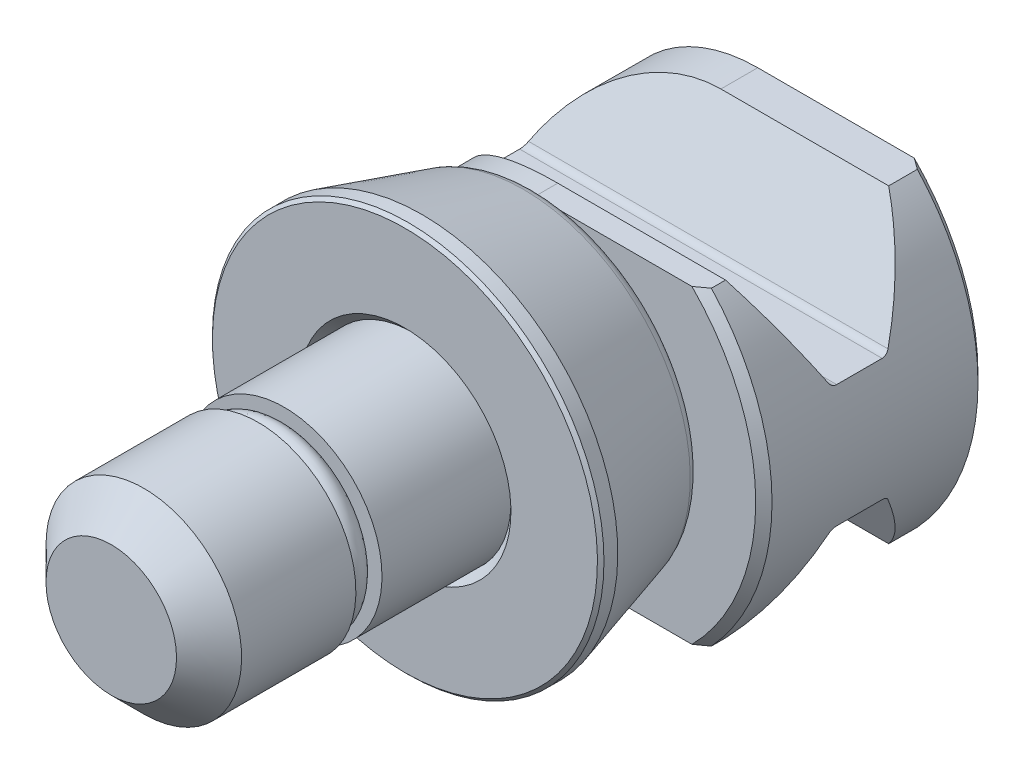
ISO-10303-21;
HEADER;
FILE_DESCRIPTION(('STEP AP214'),'2;1');
FILE_NAME('part.step','',(''),(''),'','','');
FILE_SCHEMA(('AUTOMOTIVE_DESIGN { 1 0 10303 214 1 1 1 1 }'));
ENDSEC;
DATA;
#1=APPLICATION_CONTEXT('core data for automotive mechanical design processes');
#2=APPLICATION_PROTOCOL_DEFINITION('international standard','automotive_design',2000,#1);
#3=PRODUCT_CONTEXT('',#1,'mechanical');
#4=PRODUCT('Part','Part','',(#3));
#5=PRODUCT_RELATED_PRODUCT_CATEGORY('part','',(#4));
#6=PRODUCT_DEFINITION_FORMATION('','',#4);
#7=PRODUCT_DEFINITION_CONTEXT('part definition',#1,'design');
#8=PRODUCT_DEFINITION('design','',#6,#7);
#9=PRODUCT_DEFINITION_SHAPE('','',#8);
#10=(LENGTH_UNIT() NAMED_UNIT(*) SI_UNIT(.MILLI.,.METRE.));
#11=(NAMED_UNIT(*) PLANE_ANGLE_UNIT() SI_UNIT($,.RADIAN.));
#12=(NAMED_UNIT(*) SI_UNIT($,.STERADIAN.) SOLID_ANGLE_UNIT());
#13=UNCERTAINTY_MEASURE_WITH_UNIT(LENGTH_MEASURE(1.E-05),#10,'distance_accuracy_value','');
#14=(GEOMETRIC_REPRESENTATION_CONTEXT(3) GLOBAL_UNCERTAINTY_ASSIGNED_CONTEXT((#13)) GLOBAL_UNIT_ASSIGNED_CONTEXT((#10,
#11,#12)) REPRESENTATION_CONTEXT('',''));
#15=CARTESIAN_POINT('',(0.,0.,0.));
#16=DIRECTION('',(0.,0.,1.));
#17=DIRECTION('',(1.,0.,0.));
#18=AXIS2_PLACEMENT_3D('',#15,#16,#17);
#19=CARTESIAN_POINT('',(4.8,0.,8.15));
#20=DIRECTION('',(0.,-1.,0.));
#21=DIRECTION('',(0.,0.,1.));
#22=AXIS2_PLACEMENT_3D('',#19,#20,#21);
#23=ELLIPSE('',#22,0.75,0.75);
#24=CARTESIAN_POINT('',(0.,0.,8.15));
#25=DIRECTION('',(0.,0.,-1.));
#26=AXIS1_PLACEMENT('',#24,#25);
#27=SURFACE_OF_REVOLUTION('',#23,#26);
#28=CARTESIAN_POINT('',(0.,0.,8.4));
#29=DIRECTION('',(0.,0.,-1.));
#30=DIRECTION('',(0.,1.,0.));
#31=AXIS2_PLACEMENT_3D('',#28,#29,#30);
#32=CIRCLE('',#31,4.09289321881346);
#33=CARTESIAN_POINT('',(0.,4.09289321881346,8.4));
#34=VERTEX_POINT('',#33);
#35=EDGE_CURVE('E23',#34,#34,#32,.F.);
#36=ORIENTED_EDGE('',*,*,#35,.F.);
#37=EDGE_LOOP('',(#36));
#38=FACE_BOUND('',#37,.T.);
#39=CARTESIAN_POINT('',(0.,0.,7.4));
#40=DIRECTION('',(0.,0.,-1.));
#41=DIRECTION('',(0.,1.,0.));
#42=AXIS2_PLACEMENT_3D('',#39,#40,#41);
#43=CIRCLE('',#42,4.8);
#44=CARTESIAN_POINT('',(0.,4.8,7.4));
#45=VERTEX_POINT('',#44);
#46=EDGE_CURVE('E9',#45,#45,#43,.F.);
#47=ORIENTED_EDGE('',*,*,#46,.T.);
#48=EDGE_LOOP('',(#47));
#49=FACE_BOUND('',#48,.T.);
#50=ADVANCED_FACE('F14',(#38,#49),#27,.F.);
#51=CARTESIAN_POINT('',(0.,0.,18.));
#52=DIRECTION('',(0.,0.,1.));
#53=DIRECTION('',(0.,1.,0.));
#54=AXIS2_PLACEMENT_3D('',#51,#52,#53);
#55=PLANE('',#54);
#56=CARTESIAN_POINT('',(0.,0.,18.));
#57=DIRECTION('',(0.,0.,1.));
#58=DIRECTION('',(0.,1.,0.));
#59=AXIS2_PLACEMENT_3D('',#56,#57,#58);
#60=CIRCLE('',#59,4.);
#61=CARTESIAN_POINT('',(0.,4.,18.));
#62=VERTEX_POINT('',#61);
#63=EDGE_CURVE('E298',#62,#62,#60,.T.);
#64=ORIENTED_EDGE('',*,*,#63,.T.);
#65=EDGE_LOOP('',(#64));
#66=FACE_BOUND('',#65,.T.);
#67=ADVANCED_FACE('F410',(#66),#55,.T.);
#68=CARTESIAN_POINT('',(0.,0.,16.));
#69=DIRECTION('',(0.,0.,-1.));
#70=DIRECTION('',(0.,-1.,0.));
#71=AXIS2_PLACEMENT_3D('',#68,#69,#70);
#72=CONICAL_SURFACE('',#71,6.,0.78539816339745);
#73=CARTESIAN_POINT('',(0.,0.,16.005));
#74=DIRECTION('',(0.,0.,-1.));
#75=DIRECTION('',(0.,-1.,0.));
#76=AXIS2_PLACEMENT_3D('',#73,#74,#75);
#77=CIRCLE('',#76,5.995);
#78=CARTESIAN_POINT('',(0.,-5.995,16.005));
#79=VERTEX_POINT('',#78);
#80=EDGE_CURVE('E250',#79,#79,#77,.T.);
#81=ORIENTED_EDGE('',*,*,#80,.F.);
#82=EDGE_LOOP('',(#81));
#83=FACE_BOUND('',#82,.T.);
#84=ORIENTED_EDGE('',*,*,#63,.F.);
#85=EDGE_LOOP('',(#84));
#86=FACE_BOUND('',#85,.T.);
#87=ADVANCED_FACE('F373',(#83,#86),#72,.T.);
#88=CARTESIAN_POINT('',(0.,0.,-8.));
#89=DIRECTION('',(0.,0.,-1.));
#90=DIRECTION('',(0.,-1.,0.));
#91=AXIS2_PLACEMENT_3D('',#88,#89,#90);
#92=CYLINDRICAL_SURFACE('',#91,5.995);
#93=CARTESIAN_POINT('',(0.,0.,9.));
#94=DIRECTION('',(0.,0.,-1.));
#95=DIRECTION('',(0.,-1.,0.));
#96=AXIS2_PLACEMENT_3D('',#93,#94,#95);
#97=CIRCLE('',#96,5.995);
#98=CARTESIAN_POINT('',(0.,-5.995,9.));
#99=VERTEX_POINT('',#98);
#100=EDGE_CURVE('E241',#99,#99,#97,.T.);
#101=ORIENTED_EDGE('',*,*,#100,.F.);
#102=EDGE_LOOP('',(#101));
#103=FACE_BOUND('',#102,.T.);
#104=ORIENTED_EDGE('',*,*,#80,.T.);
#105=EDGE_LOOP('',(#104));
#106=FACE_BOUND('',#105,.T.);
#107=ADVANCED_FACE('F551',(#103,#106),#92,.T.);
#108=CARTESIAN_POINT('',(-5.995,0.,9.));
#109=DIRECTION('',(0.,0.,1.));
#110=DIRECTION('',(0.,1.,0.));
#111=AXIS2_PLACEMENT_3D('',#108,#109,#110);
#112=PLANE('',#111);
#113=CARTESIAN_POINT('',(0.,0.,9.));
#114=DIRECTION('',(0.,0.,-1.));
#115=DIRECTION('',(0.,-1.,0.));
#116=AXIS2_PLACEMENT_3D('',#113,#114,#115);
#117=CIRCLE('',#116,4.05);
#118=CARTESIAN_POINT('',(0.,-4.05,9.));
#119=VERTEX_POINT('',#118);
#120=EDGE_CURVE('E209',#119,#119,#117,.T.);
#121=ORIENTED_EDGE('',*,*,#120,.F.);
#122=EDGE_LOOP('',(#121));
#123=FACE_BOUND('',#122,.T.);
#124=ORIENTED_EDGE('',*,*,#100,.T.);
#125=EDGE_LOOP('',(#124));
#126=FACE_BOUND('',#125,.T.);
#127=ADVANCED_FACE('F558',(#123,#126),#112,.F.);
#128=CARTESIAN_POINT('',(0.,0.,-8.));
#129=DIRECTION('',(0.,0.,-1.));
#130=DIRECTION('',(0.,-1.,0.));
#131=AXIS2_PLACEMENT_3D('',#128,#129,#130);
#132=CYLINDRICAL_SURFACE('',#131,4.05);
#133=CARTESIAN_POINT('',(0.,0.,8.4));
#134=DIRECTION('',(0.,0.,1.));
#135=DIRECTION('',(0.,1.,0.));
#136=AXIS2_PLACEMENT_3D('',#133,#134,#135);
#137=CIRCLE('',#136,4.05);
#138=CARTESIAN_POINT('',(0.,4.05,8.4));
#139=VERTEX_POINT('',#138);
#140=EDGE_CURVE('E237',#139,#139,#137,.T.);
#141=ORIENTED_EDGE('',*,*,#140,.T.);
#142=EDGE_LOOP('',(#141));
#143=FACE_BOUND('',#142,.T.);
#144=ORIENTED_EDGE('',*,*,#120,.T.);
#145=EDGE_LOOP('',(#144));
#146=FACE_BOUND('',#145,.T.);
#147=ADVANCED_FACE('F566',(#143,#146),#132,.T.);
#148=CARTESIAN_POINT('',(0.,0.,8.4));
#149=DIRECTION('',(0.,0.,1.));
#150=DIRECTION('',(0.,1.,0.));
#151=AXIS2_PLACEMENT_3D('',#148,#149,#150);
#152=PLANE('',#151);
#153=ORIENTED_EDGE('',*,*,#140,.F.);
#154=EDGE_LOOP('',(#153));
#155=FACE_BOUND('',#154,.T.);
#156=ORIENTED_EDGE('',*,*,#35,.T.);
#157=EDGE_LOOP('',(#156));
#158=FACE_BOUND('',#157,.T.);
#159=ADVANCED_FACE('F545',(#155,#158),#152,.T.);
#160=CARTESIAN_POINT('',(0.,0.,-7.));
#161=DIRECTION('',(0.,0.,-1.));
#162=DIRECTION('',(0.,1.,0.));
#163=AXIS2_PLACEMENT_3D('',#160,#161,#162);
#164=TOROIDAL_SURFACE('',#163,9.2524828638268,1.);
#165=CARTESIAN_POINT('',(0.,0.,-7.275637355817));
#166=DIRECTION('',(0.,0.,-1.));
#167=DIRECTION('',(0.,1.,0.));
#168=AXIS2_PLACEMENT_3D('',#165,#166,#167);
#169=CIRCLE('',#168,10.2137445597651);
#170=CARTESIAN_POINT('',(0.,10.2137445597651,-7.275637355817));
#171=VERTEX_POINT('',#170);
#172=EDGE_CURVE('E507',#171,#171,#169,.F.);
#173=ORIENTED_EDGE('',*,*,#172,.F.);
#174=EDGE_LOOP('',(#173));
#175=FACE_BOUND('',#174,.T.);
#176=CARTESIAN_POINT('',(0.,0.,-8.));
#177=DIRECTION('',(0.,0.,-1.));
#178=DIRECTION('',(0.,1.,0.));
#179=AXIS2_PLACEMENT_3D('',#176,#177,#178);
#180=CIRCLE('',#179,9.2524828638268);
#181=CARTESIAN_POINT('',(0.,9.2524828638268,-8.));
#182=VERTEX_POINT('',#181);
#183=EDGE_CURVE('E499',#182,#182,#180,.T.);
#184=ORIENTED_EDGE('',*,*,#183,.F.);
#185=EDGE_LOOP('',(#184));
#186=FACE_BOUND('',#185,.T.);
#187=ADVANCED_FACE('F538',(#175,#186),#164,.T.);
#188=CARTESIAN_POINT('',(0.,0.,-8.));
#189=DIRECTION('',(0.,0.,1.));
#190=DIRECTION('',(0.,-1.,0.));
#191=AXIS2_PLACEMENT_3D('',#188,#189,#190);
#192=CONICAL_SURFACE('',#191,10.0060369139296,0.279252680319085);
#193=ORIENTED_EDGE('',*,*,#172,.T.);
#194=EDGE_LOOP('',(#193));
#195=FACE_BOUND('',#194,.T.);
#196=CARTESIAN_POINT('',(0.,0.,-1.0462243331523));
#197=DIRECTION('',(0.,0.,-1.));
#198=DIRECTION('',(0.,1.,0.));
#199=AXIS2_PLACEMENT_3D('',#196,#197,#198);
#200=CIRCLE('',#199,12.);
#201=CARTESIAN_POINT('',(0.,12.,-1.0462243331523));
#202=VERTEX_POINT('',#201);
#203=EDGE_CURVE('E504',#202,#202,#200,.T.);
#204=ORIENTED_EDGE('',*,*,#203,.T.);
#205=EDGE_LOOP('',(#204));
#206=FACE_BOUND('',#205,.T.);
#207=ADVANCED_FACE('F594',(#195,#206),#192,.T.);
#208=CARTESIAN_POINT('',(0.,0.,0.));
#209=DIRECTION('',(0.,0.,-1.));
#210=DIRECTION('',(0.,1.,0.));
#211=AXIS2_PLACEMENT_3D('',#208,#209,#210);
#212=CYLINDRICAL_SURFACE('',#211,12.);
#213=CARTESIAN_POINT('',(0.,0.,-0.2));
#214=DIRECTION('',(0.,0.,1.));
#215=DIRECTION('',(0.,-1.,0.));
#216=AXIS2_PLACEMENT_3D('',#213,#214,#215);
#217=CIRCLE('',#216,12.);
#218=CARTESIAN_POINT('',(0.,-12.,-0.2));
#219=VERTEX_POINT('',#218);
#220=EDGE_CURVE('E515',#219,#219,#217,.F.);
#221=ORIENTED_EDGE('',*,*,#220,.T.);
#222=EDGE_LOOP('',(#221));
#223=FACE_BOUND('',#222,.T.);
#224=ORIENTED_EDGE('',*,*,#203,.F.);
#225=EDGE_LOOP('',(#224));
#226=FACE_BOUND('',#225,.T.);
#227=ADVANCED_FACE('F537',(#223,#226),#212,.T.);
#228=CARTESIAN_POINT('',(0.,0.,0.));
#229=DIRECTION('',(0.,0.,-1.));
#230=DIRECTION('',(0.,1.,0.));
#231=AXIS2_PLACEMENT_3D('',#228,#229,#230);
#232=CYLINDRICAL_SURFACE('',#231,6.);
#233=CARTESIAN_POINT('',(0.,0.,-0.5));
#234=DIRECTION('',(0.,0.,1.));
#235=DIRECTION('',(0.,-1.,0.));
#236=AXIS2_PLACEMENT_3D('',#233,#234,#235);
#237=CIRCLE('',#236,6.);
#238=CARTESIAN_POINT('',(0.,-6.,-0.5));
#239=VERTEX_POINT('',#238);
#240=EDGE_CURVE('E513',#239,#239,#237,.T.);
#241=ORIENTED_EDGE('',*,*,#240,.T.);
#242=EDGE_LOOP('',(#241));
#243=FACE_BOUND('',#242,.T.);
#244=CARTESIAN_POINT('',(0.,0.,-1.));
#245=DIRECTION('',(0.,0.,-1.));
#246=DIRECTION('',(0.,-1.,0.));
#247=AXIS2_PLACEMENT_3D('',#244,#245,#246);
#248=CIRCLE('',#247,6.);
#249=CARTESIAN_POINT('',(0.,-6.,-1.));
#250=VERTEX_POINT('',#249);
#251=EDGE_CURVE('E244',#250,#250,#248,.T.);
#252=ORIENTED_EDGE('',*,*,#251,.T.);
#253=EDGE_LOOP('',(#252));
#254=FACE_BOUND('',#253,.T.);
#255=ADVANCED_FACE('F540',(#243,#254),#232,.F.);
#256=CARTESIAN_POINT('',(0.,0.,0.));
#257=DIRECTION('',(0.,0.,1.));
#258=DIRECTION('',(0.,-1.,0.));
#259=AXIS2_PLACEMENT_3D('',#256,#257,#258);
#260=CONICAL_SURFACE('',#259,6.5,0.785398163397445);
#261=ORIENTED_EDGE('',*,*,#240,.F.);
#262=EDGE_LOOP('',(#261));
#263=FACE_BOUND('',#262,.T.);
#264=CARTESIAN_POINT('',(0.,0.,0.));
#265=DIRECTION('',(0.,0.,1.));
#266=DIRECTION('',(0.,-1.,0.));
#267=AXIS2_PLACEMENT_3D('',#264,#265,#266);
#268=CIRCLE('',#267,6.5);
#269=CARTESIAN_POINT('',(0.,-6.5,0.));
#270=VERTEX_POINT('',#269);
#271=EDGE_CURVE('E510',#270,#270,#268,.F.);
#272=ORIENTED_EDGE('',*,*,#271,.F.);
#273=EDGE_LOOP('',(#272));
#274=FACE_BOUND('',#273,.T.);
#275=ADVANCED_FACE('F528',(#263,#274),#260,.F.);
#276=CARTESIAN_POINT('',(6.,0.,0.));
#277=DIRECTION('',(0.,0.,1.));
#278=DIRECTION('',(0.,-1.,0.));
#279=AXIS2_PLACEMENT_3D('',#276,#277,#278);
#280=PLANE('',#279);
#281=CARTESIAN_POINT('',(0.,0.,0.));
#282=DIRECTION('',(0.,0.,1.));
#283=DIRECTION('',(0.,-1.,0.));
#284=AXIS2_PLACEMENT_3D('',#281,#282,#283);
#285=CIRCLE('',#284,11.8);
#286=CARTESIAN_POINT('',(0.,-11.8,0.));
#287=VERTEX_POINT('',#286);
#288=EDGE_CURVE('E18',#287,#287,#285,.T.);
#289=ORIENTED_EDGE('',*,*,#288,.T.);
#290=EDGE_LOOP('',(#289));
#291=FACE_BOUND('',#290,.T.);
#292=ORIENTED_EDGE('',*,*,#271,.T.);
#293=EDGE_LOOP('',(#292));
#294=FACE_BOUND('',#293,.T.);
#295=ADVANCED_FACE('F522',(#291,#294),#280,.T.);
#296=CARTESIAN_POINT('',(0.,0.,-0.2));
#297=DIRECTION('',(0.,0.,-1.));
#298=DIRECTION('',(0.,1.,0.));
#299=AXIS2_PLACEMENT_3D('',#296,#297,#298);
#300=CONICAL_SURFACE('',#299,12.,0.785398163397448);
#301=ORIENTED_EDGE('',*,*,#288,.F.);
#302=EDGE_LOOP('',(#301));
#303=FACE_BOUND('',#302,.T.);
#304=ORIENTED_EDGE('',*,*,#220,.F.);
#305=EDGE_LOOP('',(#304));
#306=FACE_BOUND('',#305,.T.);
#307=ADVANCED_FACE('F16',(#303,#306),#300,.T.);
#308=CARTESIAN_POINT('',(-6.,0.,-1.));
#309=DIRECTION('',(0.,0.,-1.));
#310=DIRECTION('',(0.,-1.,0.));
#311=AXIS2_PLACEMENT_3D('',#308,#309,#310);
#312=PLANE('',#311);
#313=ORIENTED_EDGE('',*,*,#251,.F.);
#314=EDGE_LOOP('',(#313));
#315=FACE_BOUND('',#314,.T.);
#316=CARTESIAN_POINT('',(0.,0.,-1.));
#317=DIRECTION('',(0.,0.,-1.));
#318=DIRECTION('',(0.,-1.,0.));
#319=AXIS2_PLACEMENT_3D('',#316,#317,#318);
#320=CIRCLE('',#319,5.995);
#321=CARTESIAN_POINT('',(0.,-5.995,-1.));
#322=VERTEX_POINT('',#321);
#323=EDGE_CURVE('E247',#322,#322,#320,.T.);
#324=ORIENTED_EDGE('',*,*,#323,.T.);
#325=EDGE_LOOP('',(#324));
#326=FACE_BOUND('',#325,.T.);
#327=ADVANCED_FACE('F527',(#315,#326),#312,.F.);
#328=CARTESIAN_POINT('',(0.,0.,7.4));
#329=DIRECTION('',(0.,0.,-1.));
#330=DIRECTION('',(0.,-1.,0.));
#331=AXIS2_PLACEMENT_3D('',#328,#329,#330);
#332=CIRCLE('',#331,5.995);
#333=CARTESIAN_POINT('',(0.,-5.995,7.4));
#334=VERTEX_POINT('',#333);
#335=EDGE_CURVE('E205',#334,#334,#332,.T.);
#336=ORIENTED_EDGE('',*,*,#335,.T.);
#337=EDGE_LOOP('',(#336));
#338=FACE_BOUND('',#337,.T.);
#339=ORIENTED_EDGE('',*,*,#323,.F.);
#340=EDGE_LOOP('',(#339));
#341=FACE_BOUND('',#340,.T.);
#342=ADVANCED_FACE('F534',(#338,#341),#92,.T.);
#343=CARTESIAN_POINT('',(-5.995,0.,7.4));
#344=DIRECTION('',(0.,0.,-1.));
#345=DIRECTION('',(0.,-1.,0.));
#346=AXIS2_PLACEMENT_3D('',#343,#344,#345);
#347=PLANE('',#346);
#348=ORIENTED_EDGE('',*,*,#46,.F.);
#349=EDGE_LOOP('',(#348));
#350=FACE_BOUND('',#349,.T.);
#351=ORIENTED_EDGE('',*,*,#335,.F.);
#352=EDGE_LOOP('',(#351));
#353=FACE_BOUND('',#352,.T.);
#354=ADVANCED_FACE('F572',(#350,#353),#347,.F.);
#355=CARTESIAN_POINT('',(0.,0.,-8.));
#356=DIRECTION('',(0.,0.,1.));
#357=DIRECTION('',(0.,1.,0.));
#358=AXIS2_PLACEMENT_3D('',#355,#356,#357);
#359=PLANE('',#358);
#360=ORIENTED_EDGE('',*,*,#183,.T.);
#361=EDGE_LOOP('',(#360));
#362=FACE_BOUND('',#361,.T.);
#363=DIRECTION('',(-1.,0.,0.));
#364=VECTOR('',#363,1.);
#365=CARTESIAN_POINT('',(0.,-9.5,-8.));
#366=LINE('',#365,#364);
#367=CARTESIAN_POINT('',(9.59166304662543,-9.5,-8.));
#368=VERTEX_POINT('',#367);
#369=CARTESIAN_POINT('',(0.,-9.5,-8.));
#370=VERTEX_POINT('',#369);
#371=EDGE_CURVE('E301',#368,#370,#366,.T.);
#372=ORIENTED_EDGE('',*,*,#371,.F.);
#373=CARTESIAN_POINT('',(0.,0.,-8.));
#374=DIRECTION('',(0.,0.,1.));
#375=DIRECTION('',(0.,1.,0.));
#376=AXIS2_PLACEMENT_3D('',#373,#374,#375);
#377=CIRCLE('',#376,13.5);
#378=CARTESIAN_POINT('',(9.59166304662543,9.5,-8.));
#379=VERTEX_POINT('',#378);
#380=EDGE_CURVE('E465',#368,#379,#377,.T.);
#381=ORIENTED_EDGE('',*,*,#380,.T.);
#382=DIRECTION('',(1.,0.,0.));
#383=VECTOR('',#382,1.);
#384=CARTESIAN_POINT('',(0.,9.5,-8.));
#385=LINE('',#384,#383);
#386=CARTESIAN_POINT('',(0.,9.5,-8.));
#387=VERTEX_POINT('',#386);
#388=EDGE_CURVE('E303',#387,#379,#385,.T.);
#389=ORIENTED_EDGE('',*,*,#388,.F.);
#390=CARTESIAN_POINT('',(0.,0.,-8.));
#391=DIRECTION('',(0.,0.,-1.));
#392=DIRECTION('',(0.,1.,0.));
#393=AXIS2_PLACEMENT_3D('',#390,#391,#392);
#394=CIRCLE('',#393,9.5);
#395=EDGE_CURVE('E282',#370,#387,#394,.T.);
#396=ORIENTED_EDGE('',*,*,#395,.F.);
#397=EDGE_LOOP('',(#372,#381,#389,#396));
#398=FACE_BOUND('',#397,.T.);
#399=ADVANCED_FACE('F408',(#362,#398),#359,.T.);
#400=CARTESIAN_POINT('',(15.,-9.5,-56.4039906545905));
#401=DIRECTION('',(0.,1.,0.));
#402=DIRECTION('',(0.,0.,-1.));
#403=AXIS2_PLACEMENT_3D('',#400,#401,#402);
#404=PLANE('',#403);
#405=DIRECTION('',(0.,0.,-1.));
#406=VECTOR('',#405,1.);
#407=CARTESIAN_POINT('',(10.2834819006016,-9.5,-8.));
#408=LINE('',#407,#406);
#409=CARTESIAN_POINT('',(10.2834819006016,-9.5,-9.3674137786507));
#410=VERTEX_POINT('',#409);
#411=CARTESIAN_POINT('',(10.2834819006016,-9.5,-8.5));
#412=VERTEX_POINT('',#411);
#413=EDGE_CURVE('E294',#410,#412,#408,.F.);
#414=ORIENTED_EDGE('',*,*,#413,.T.);
#415=CARTESIAN_POINT('',(10.2834819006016,-9.5,-8.5));
#416=CARTESIAN_POINT('',(10.1688365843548,-9.5,-8.41575654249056));
#417=CARTESIAN_POINT('',(10.0538623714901,-9.5,-8.33196815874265));
#418=CARTESIAN_POINT('',(9.82325608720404,-9.5,-8.16530149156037));
#419=CARTESIAN_POINT('',(9.70762401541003,-9.5,-8.08242320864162));
#420=CARTESIAN_POINT('',(9.59166304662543,-9.5,-8.));
#421=B_SPLINE_CURVE_WITH_KNOTS('',3,(#415,#416,#417,#418,#419,#420),.UNSPECIFIED.,.F.,.F.,(4,2,
4),(0.,0.426797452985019,0.853595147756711),.UNSPECIFIED.);
#422=EDGE_CURVE('E451',#412,#368,#421,.T.);
#423=ORIENTED_EDGE('',*,*,#422,.T.);
#424=ORIENTED_EDGE('',*,*,#371,.T.);
#425=DIRECTION('',(0.,0.,1.));
#426=VECTOR('',#425,1.);
#427=CARTESIAN_POINT('',(0.,-9.5,-40.));
#428=LINE('',#427,#426);
#429=CARTESIAN_POINT('',(0.,-9.5,-9.3674137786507));
#430=VERTEX_POINT('',#429);
#431=EDGE_CURVE('E285',#430,#370,#428,.T.);
#432=ORIENTED_EDGE('',*,*,#431,.F.);
#433=DIRECTION('',(1.,0.,0.));
#434=VECTOR('',#433,1.);
#435=CARTESIAN_POINT('',(15.,-9.5,-9.3674137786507));
#436=LINE('',#435,#434);
#437=EDGE_CURVE('E311',#430,#410,#436,.T.);
#438=ORIENTED_EDGE('',*,*,#437,.T.);
#439=EDGE_LOOP('',(#414,#423,#424,#432,#438));
#440=FACE_BOUND('',#439,.T.);
#441=ADVANCED_FACE('F445',(#440),#404,.F.);
#442=CARTESIAN_POINT('',(0.,0.,-8.5));
#443=DIRECTION('',(0.,0.,-1.));
#444=DIRECTION('',(0.,-1.,0.));
#445=AXIS2_PLACEMENT_3D('',#442,#443,#444);
#446=CONICAL_SURFACE('',#445,14.,0.785398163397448);
#447=CARTESIAN_POINT('',(9.59166304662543,9.5,-8.));
#448=CARTESIAN_POINT('',(9.70762401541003,9.50000000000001,-8.08242320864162));
#449=CARTESIAN_POINT('',(9.82325608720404,9.50000000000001,-8.16530149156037));
#450=CARTESIAN_POINT('',(10.0538623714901,9.50000000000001,-8.33196815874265));
#451=CARTESIAN_POINT('',(10.1688365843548,9.50000000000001,-8.41575654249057));
#452=CARTESIAN_POINT('',(10.2834819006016,9.5,-8.5));
#453=B_SPLINE_CURVE_WITH_KNOTS('',3,(#447,#448,#449,#450,#451,#452),.UNSPECIFIED.,.F.,.F.,(4,2,
4),(0.,0.426797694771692,0.853595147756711),.UNSPECIFIED.);
#454=CARTESIAN_POINT('',(10.2834819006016,9.5,-8.5));
#455=VERTEX_POINT('',#454);
#456=EDGE_CURVE('E458',#379,#455,#453,.T.);
#457=ORIENTED_EDGE('',*,*,#456,.F.);
#458=ORIENTED_EDGE('',*,*,#380,.F.);
#459=ORIENTED_EDGE('',*,*,#422,.F.);
#460=CARTESIAN_POINT('',(0.,0.,-8.5));
#461=DIRECTION('',(0.,0.,1.));
#462=DIRECTION('',(0.,1.,0.));
#463=AXIS2_PLACEMENT_3D('',#460,#461,#462);
#464=CIRCLE('',#463,14.);
#465=EDGE_CURVE('E624',#455,#412,#464,.F.);
#466=ORIENTED_EDGE('',*,*,#465,.F.);
#467=EDGE_LOOP('',(#457,#458,#459,#466));
#468=FACE_BOUND('',#467,.T.);
#469=ADVANCED_FACE('F439',(#468),#446,.T.);
#470=CARTESIAN_POINT('',(15.,9.5,-56.4039906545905));
#471=DIRECTION('',(0.,-1.,0.));
#472=DIRECTION('',(0.,0.,1.));
#473=AXIS2_PLACEMENT_3D('',#470,#471,#472);
#474=PLANE('',#473);
#475=ORIENTED_EDGE('',*,*,#388,.T.);
#476=ORIENTED_EDGE('',*,*,#456,.T.);
#477=DIRECTION('',(0.,0.,-1.));
#478=VECTOR('',#477,1.);
#479=CARTESIAN_POINT('',(10.2834819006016,9.5,-8.));
#480=LINE('',#479,#478);
#481=CARTESIAN_POINT('',(10.2834819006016,9.5,-9.3674137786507));
#482=VERTEX_POINT('',#481);
#483=EDGE_CURVE('E292',#455,#482,#480,.T.);
#484=ORIENTED_EDGE('',*,*,#483,.T.);
#485=DIRECTION('',(-1.,0.,0.));
#486=VECTOR('',#485,1.);
#487=CARTESIAN_POINT('',(15.,9.5,-9.3674137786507));
#488=LINE('',#487,#486);
#489=CARTESIAN_POINT('',(0.,9.5,-9.3674137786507));
#490=VERTEX_POINT('',#489);
#491=EDGE_CURVE('E256',#482,#490,#488,.T.);
#492=ORIENTED_EDGE('',*,*,#491,.T.);
#493=DIRECTION('',(0.,0.,1.));
#494=VECTOR('',#493,1.);
#495=CARTESIAN_POINT('',(0.,9.5,-40.));
#496=LINE('',#495,#494);
#497=EDGE_CURVE('E286',#490,#387,#496,.T.);
#498=ORIENTED_EDGE('',*,*,#497,.T.);
#499=EDGE_LOOP('',(#475,#476,#484,#492,#498));
#500=FACE_BOUND('',#499,.T.);
#501=ADVANCED_FACE('F444',(#500),#474,.F.);
#502=CARTESIAN_POINT('',(0.,0.,-40.));
#503=DIRECTION('',(0.,0.,1.));
#504=DIRECTION('',(0.,1.,0.));
#505=AXIS2_PLACEMENT_3D('',#502,#503,#504);
#506=CYLINDRICAL_SURFACE('',#505,9.5);
#507=CARTESIAN_POINT('',(0.,0.,-13.8825862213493));
#508=DIRECTION('',(0.,0.5,0.86602540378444));
#509=DIRECTION('',(0.,-0.866025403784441,0.5));
#510=AXIS2_PLACEMENT_3D('',#507,#508,#509);
#511=ELLIPSE('',#510,10.9696551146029,9.5);
#512=CARTESIAN_POINT('',(0.,9.5,-19.3674137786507));
#513=VERTEX_POINT('',#512);
#514=CARTESIAN_POINT('',(-8.61684396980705,4.,-16.1919872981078));
#515=VERTEX_POINT('',#514);
#516=EDGE_CURVE('E263',#513,#515,#511,.T.);
#517=ORIENTED_EDGE('',*,*,#516,.F.);
#518=CARTESIAN_POINT('',(0.,9.5,-21.625));
#519=VERTEX_POINT('',#518);
#520=EDGE_CURVE('E288',#519,#513,#496,.T.);
#521=ORIENTED_EDGE('',*,*,#520,.F.);
#522=CARTESIAN_POINT('',(0.,0.,-21.625));
#523=DIRECTION('',(0.,0.,1.));
#524=DIRECTION('',(0.,1.,0.));
#525=AXIS2_PLACEMENT_3D('',#522,#523,#524);
#526=CIRCLE('',#525,9.5);
#527=CARTESIAN_POINT('',(0.,-9.5,-21.625));
#528=VERTEX_POINT('',#527);
#529=EDGE_CURVE('E306',#519,#528,#526,.T.);
#530=ORIENTED_EDGE('',*,*,#529,.T.);
#531=CARTESIAN_POINT('',(0.,-9.5,-19.3674137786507));
#532=VERTEX_POINT('',#531);
#533=EDGE_CURVE('E289',#528,#532,#428,.T.);
#534=ORIENTED_EDGE('',*,*,#533,.T.);
#535=CARTESIAN_POINT('',(0.,0.,-13.8825862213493));
#536=DIRECTION('',(0.,0.5,-0.86602540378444));
#537=DIRECTION('',(0.,0.866025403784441,0.5));
#538=AXIS2_PLACEMENT_3D('',#535,#536,#537);
#539=ELLIPSE('',#538,10.9696551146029,9.5);
#540=CARTESIAN_POINT('',(-8.61684396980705,-4.,-16.1919872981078));
#541=VERTEX_POINT('',#540);
#542=EDGE_CURVE('E272',#532,#541,#539,.T.);
#543=ORIENTED_EDGE('',*,*,#542,.T.);
#544=CARTESIAN_POINT('',(-8.61684396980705,-4.,-16.1919872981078));
#545=CARTESIAN_POINT('',(-8.62782988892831,-3.9763405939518,-16.1783539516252));
#546=CARTESIAN_POINT('',(-8.63826486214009,-3.95359947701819,-16.1626141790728));
#547=CARTESIAN_POINT('',(-8.65779662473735,-3.91063964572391,-16.1272210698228));
#548=CARTESIAN_POINT('',(-8.66689002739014,-3.89042733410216,-16.1075581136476));
#549=CARTESIAN_POINT('',(-8.6834728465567,-3.85327385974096,-16.064617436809));
#550=CARTESIAN_POINT('',(-8.6909568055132,-3.83634384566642,-16.0413278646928));
#551=CARTESIAN_POINT('',(-8.70402475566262,-3.8066016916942,-15.9918471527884));
#552=CARTESIAN_POINT('',(-8.709613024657,-3.79378028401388,-15.9656627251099));
#553=CARTESIAN_POINT('',(-8.7188728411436,-3.77245264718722,-15.9101689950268));
#554=CARTESIAN_POINT('',(-8.72247157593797,-3.76411063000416,-15.8807830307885));
#555=CARTESIAN_POINT('',(-8.72610105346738,-3.75568486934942,-15.8357221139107));
#556=CARTESIAN_POINT('',(-8.7270161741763,-3.75355728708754,-15.8204707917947));
#557=CARTESIAN_POINT('',(-8.7282383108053,-3.75071422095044,-15.7898080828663));
#558=CARTESIAN_POINT('',(-8.7285451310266,-3.74999919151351,-15.7743966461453));
#559=CARTESIAN_POINT('',(-8.72854512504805,-3.75,-15.7589745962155));
#560=B_SPLINE_CURVE_WITH_KNOTS('',3,(#544,#545,#546,#547,#548,#549,#550,#551,#552,#553,#554,
#555,#556,#557,#558,#559),.UNSPECIFIED.,.F.,.F.,(4,2,2,2,2,2,2,4),(0.,0.0882580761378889,
0.176735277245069,0.265507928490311,0.354078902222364,0.445706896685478,0.491917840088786,
0.538143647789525),.UNSPECIFIED.);
#561=CARTESIAN_POINT('',(-8.72854512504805,-3.75,-15.7589745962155));
#562=VERTEX_POINT('',#561);
#563=EDGE_CURVE('E346',#541,#562,#560,.T.);
#564=ORIENTED_EDGE('',*,*,#563,.T.);
#565=DIRECTION('',(0.,0.,1.));
#566=VECTOR('',#565,1.);
#567=CARTESIAN_POINT('',(-8.72854512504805,-3.75,-40.));
#568=LINE('',#567,#566);
#569=CARTESIAN_POINT('',(-8.72854512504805,-3.75,-12.9758529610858));
#570=VERTEX_POINT('',#569);
#571=EDGE_CURVE('E279',#562,#570,#568,.T.);
#572=ORIENTED_EDGE('',*,*,#571,.T.);
#573=CARTESIAN_POINT('',(-8.72854512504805,-3.75,-12.9758529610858));
#574=CARTESIAN_POINT('',(-8.72855476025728,-3.74996956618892,-12.9494301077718));
#575=CARTESIAN_POINT('',(-8.72764615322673,-3.75209240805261,-12.9230258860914));
#576=CARTESIAN_POINT('',(-8.72406873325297,-3.76040700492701,-12.8710645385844));
#577=CARTESIAN_POINT('',(-8.72140503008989,-3.76658694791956,-12.8455051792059));
#578=CARTESIAN_POINT('',(-8.71439385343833,-3.78277840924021,-12.7958883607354));
#579=CARTESIAN_POINT('',(-8.71004683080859,-3.792788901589,-12.7718305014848));
#580=CARTESIAN_POINT('',(-8.69979515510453,-3.81624533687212,-12.7258049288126));
#581=CARTESIAN_POINT('',(-8.69388960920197,-3.82969324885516,-12.7038384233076));
#582=CARTESIAN_POINT('',(-8.68047873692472,-3.85999626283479,-12.6618661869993));
#583=CARTESIAN_POINT('',(-8.67293032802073,-3.87694232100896,-12.6419401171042));
#584=CARTESIAN_POINT('',(-8.65654704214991,-3.91338591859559,-12.6052333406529));
#585=CARTESIAN_POINT('',(-8.64771293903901,-3.93288192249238,-12.5884507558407));
#586=CARTESIAN_POINT('',(-8.63145164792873,-3.9684156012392,-12.5622562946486));
#587=CARTESIAN_POINT('',(-8.62427227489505,-3.98400005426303,-12.5520698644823));
#588=CARTESIAN_POINT('',(-8.61684396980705,-4.,-12.5428402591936));
#589=B_SPLINE_CURVE_WITH_KNOTS('',3,(#573,#574,#575,#576,#577,#578,#579,#580,#581,#582,#583,
#584,#585,#586,#587,#588),.UNSPECIFIED.,.F.,.F.,(4,2,2,2,2,2,2,4),(0.,0.0791389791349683,
0.15804856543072,0.236937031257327,0.31587078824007,0.397198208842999,0.478476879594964,
0.538209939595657),.UNSPECIFIED.);
#590=CARTESIAN_POINT('',(-8.61684396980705,-4.,-12.5428402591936));
#591=VERTEX_POINT('',#590);
#592=EDGE_CURVE('E385',#570,#591,#589,.T.);
#593=ORIENTED_EDGE('',*,*,#592,.T.);
#594=CARTESIAN_POINT('',(0.,0.,-14.8522413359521));
#595=DIRECTION('',(0.,0.5,0.86602540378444));
#596=DIRECTION('',(0.,-0.86602540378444,0.5));
#597=AXIS2_PLACEMENT_3D('',#594,#595,#596);
#598=ELLIPSE('',#597,10.9696551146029,9.5);
#599=EDGE_CURVE('E277',#591,#430,#598,.T.);
#600=ORIENTED_EDGE('',*,*,#599,.T.);
#601=ORIENTED_EDGE('',*,*,#431,.T.);
#602=ORIENTED_EDGE('',*,*,#395,.T.);
#603=ORIENTED_EDGE('',*,*,#497,.F.);
#604=CARTESIAN_POINT('',(0.,0.,-14.8522413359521));
#605=DIRECTION('',(0.,0.5,-0.86602540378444));
#606=DIRECTION('',(0.,0.86602540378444,0.5));
#607=AXIS2_PLACEMENT_3D('',#604,#605,#606);
#608=ELLIPSE('',#607,10.9696551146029,9.5);
#609=CARTESIAN_POINT('',(-8.61684396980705,4.,-12.5428402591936));
#610=VERTEX_POINT('',#609);
#611=EDGE_CURVE('E259',#610,#490,#608,.T.);
#612=ORIENTED_EDGE('',*,*,#611,.F.);
#613=CARTESIAN_POINT('',(-8.61684396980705,4.,-12.5428402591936));
#614=CARTESIAN_POINT('',(-8.62782988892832,3.97634059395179,-12.5564736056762));
#615=CARTESIAN_POINT('',(-8.63826486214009,3.95359947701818,-12.5722133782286));
#616=CARTESIAN_POINT('',(-8.65779662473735,3.9106396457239,-12.6076064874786));
#617=CARTESIAN_POINT('',(-8.66689002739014,3.89042733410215,-12.6272694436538));
#618=CARTESIAN_POINT('',(-8.6834728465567,3.85327385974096,-12.6702101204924));
#619=CARTESIAN_POINT('',(-8.6909568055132,3.83634384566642,-12.6934996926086));
#620=CARTESIAN_POINT('',(-8.70402475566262,3.8066016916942,-12.742980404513));
#621=CARTESIAN_POINT('',(-8.709613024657,3.79378028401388,-12.7691648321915));
#622=CARTESIAN_POINT('',(-8.7188728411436,3.77245264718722,-12.8246585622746));
#623=CARTESIAN_POINT('',(-8.72247157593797,3.76411063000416,-12.854044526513));
#624=CARTESIAN_POINT('',(-8.72610105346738,3.75568486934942,-12.8991054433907));
#625=CARTESIAN_POINT('',(-8.7270161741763,3.75355728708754,-12.9143567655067));
#626=CARTESIAN_POINT('',(-8.7282383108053,3.75071422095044,-12.9450194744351));
#627=CARTESIAN_POINT('',(-8.7285451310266,3.74999919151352,-12.9604309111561));
#628=CARTESIAN_POINT('',(-8.72854512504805,3.75,-12.9758529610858));
#629=B_SPLINE_CURVE_WITH_KNOTS('',3,(#613,#614,#615,#616,#617,#618,#619,#620,#621,#622,#623,
#624,#625,#626,#627,#628),.UNSPECIFIED.,.F.,.F.,(4,2,2,2,2,2,2,4),(0.,0.0882580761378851,
0.176735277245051,0.26550792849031,0.354078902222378,0.445706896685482,0.491917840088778,
0.538143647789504),.UNSPECIFIED.);
#630=CARTESIAN_POINT('',(-8.72854512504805,3.75,-12.9758529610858));
#631=VERTEX_POINT('',#630);
#632=EDGE_CURVE('E397',#610,#631,#629,.T.);
#633=ORIENTED_EDGE('',*,*,#632,.T.);
#634=DIRECTION('',(0.,0.,1.));
#635=VECTOR('',#634,1.);
#636=CARTESIAN_POINT('',(-8.72854512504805,3.75,-40.));
#637=LINE('',#636,#635);
#638=CARTESIAN_POINT('',(-8.72854512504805,3.75,-15.7589745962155));
#639=VERTEX_POINT('',#638);
#640=EDGE_CURVE('E266',#639,#631,#637,.T.);
#641=ORIENTED_EDGE('',*,*,#640,.F.);
#642=CARTESIAN_POINT('',(-8.72854512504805,3.75,-15.7589745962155));
#643=CARTESIAN_POINT('',(-8.72855476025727,3.74996956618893,-15.7853974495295));
#644=CARTESIAN_POINT('',(-8.72764615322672,3.75209240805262,-15.81180167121));
#645=CARTESIAN_POINT('',(-8.72406873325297,3.76040700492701,-15.863763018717));
#646=CARTESIAN_POINT('',(-8.7214050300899,3.76658694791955,-15.8893223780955));
#647=CARTESIAN_POINT('',(-8.71439385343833,3.78277840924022,-15.938939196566));
#648=CARTESIAN_POINT('',(-8.71004683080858,3.79278890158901,-15.9629970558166));
#649=CARTESIAN_POINT('',(-8.69979515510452,3.81624533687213,-16.0090226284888));
#650=CARTESIAN_POINT('',(-8.69388960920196,3.82969324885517,-16.0309891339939));
#651=CARTESIAN_POINT('',(-8.68047873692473,3.85999626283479,-16.0729613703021));
#652=CARTESIAN_POINT('',(-8.67293032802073,3.87694232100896,-16.0928874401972));
#653=CARTESIAN_POINT('',(-8.65654704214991,3.91338591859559,-16.1295942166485));
#654=CARTESIAN_POINT('',(-8.647712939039,3.93288192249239,-16.1463768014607));
#655=CARTESIAN_POINT('',(-8.63145164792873,3.96841560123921,-16.1725712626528));
#656=CARTESIAN_POINT('',(-8.62427227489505,3.98400005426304,-16.1827576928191));
#657=CARTESIAN_POINT('',(-8.61684396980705,4.,-16.1919872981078));
#658=B_SPLINE_CURVE_WITH_KNOTS('',3,(#642,#643,#644,#645,#646,#647,#648,#649,#650,#651,#652,
#653,#654,#655,#656,#657),.UNSPECIFIED.,.F.,.F.,(4,2,2,2,2,2,2,4),(0.,0.0791389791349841,
0.158048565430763,0.236937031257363,0.315870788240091,0.397198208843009,0.478476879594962,
0.538209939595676),.UNSPECIFIED.);
#659=EDGE_CURVE('E421',#639,#515,#658,.T.);
#660=ORIENTED_EDGE('',*,*,#659,.T.);
#661=EDGE_LOOP('',(#517,#521,#530,#534,#543,#564,#572,#593,#600,#601,#602,#603,#612,#633,#641,#660));
#662=FACE_BOUND('',#661,.T.);
#663=ADVANCED_FACE('F361',(#662),#506,.T.);
#664=CARTESIAN_POINT('',(0.,0.,-8.));
#665=DIRECTION('',(0.,0.,-1.));
#666=DIRECTION('',(0.,-1.,0.));
#667=AXIS2_PLACEMENT_3D('',#664,#665,#666);
#668=CYLINDRICAL_SURFACE('',#667,14.);
#669=CARTESIAN_POINT('',(10.2834819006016,-9.5,-21.125));
#670=VERTEX_POINT('',#669);
#671=CARTESIAN_POINT('',(10.2834819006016,-9.5,-19.3674137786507));
#672=VERTEX_POINT('',#671);
#673=EDGE_CURVE('E296',#670,#672,#408,.F.);
#674=ORIENTED_EDGE('',*,*,#673,.F.);
#675=CARTESIAN_POINT('',(0.,0.,-21.125));
#676=DIRECTION('',(0.,0.,1.));
#677=DIRECTION('',(0.,1.,0.));
#678=AXIS2_PLACEMENT_3D('',#675,#676,#677);
#679=CIRCLE('',#678,14.);
#680=CARTESIAN_POINT('',(10.2834819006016,9.5,-21.125));
#681=VERTEX_POINT('',#680);
#682=EDGE_CURVE('E39',#670,#681,#679,.T.);
#683=ORIENTED_EDGE('',*,*,#682,.T.);
#684=CARTESIAN_POINT('',(10.2834819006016,9.5,-19.3674137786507));
#685=VERTEX_POINT('',#684);
#686=EDGE_CURVE('E295',#685,#681,#480,.T.);
#687=ORIENTED_EDGE('',*,*,#686,.F.);
#688=CARTESIAN_POINT('',(0.,0.,-13.8825862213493));
#689=DIRECTION('',(0.,0.5,0.86602540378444));
#690=DIRECTION('',(0.,0.866025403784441,-0.5));
#691=AXIS2_PLACEMENT_3D('',#688,#689,#690);
#692=ELLIPSE('',#691,16.1658075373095,14.);
#693=CARTESIAN_POINT('',(13.4164078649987,4.,-16.1919872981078));
#694=VERTEX_POINT('',#693);
#695=EDGE_CURVE('E323',#685,#694,#692,.F.);
#696=ORIENTED_EDGE('',*,*,#695,.T.);
#697=CARTESIAN_POINT('',(13.4164078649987,4.,-16.1919872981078));
#698=CARTESIAN_POINT('',(13.4235732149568,3.97597138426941,-16.1781420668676));
#699=CARTESIAN_POINT('',(13.430343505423,3.95302243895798,-16.1622011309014));
#700=CARTESIAN_POINT('',(13.442947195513,3.90994436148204,-16.1265844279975));
#701=CARTESIAN_POINT('',(13.4487806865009,3.88981495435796,-16.1069090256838));
#702=CARTESIAN_POINT('',(13.4593755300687,3.85299648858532,-16.0642365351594));
#703=CARTESIAN_POINT('',(13.4641348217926,3.83631404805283,-16.0412331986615));
#704=CARTESIAN_POINT('',(13.4724456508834,3.8070250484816,-15.9925959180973));
#705=CARTESIAN_POINT('',(13.4759981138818,3.79441536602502,-15.9669640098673));
#706=CARTESIAN_POINT('',(13.4820367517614,3.77290630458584,-15.9117007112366));
#707=CARTESIAN_POINT('',(13.4844186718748,3.76437119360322,-15.8819133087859));
#708=CARTESIAN_POINT('',(13.486813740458,3.7557772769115,-15.8363443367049));
#709=CARTESIAN_POINT('',(13.4874158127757,3.75361399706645,-15.8209603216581));
#710=CARTESIAN_POINT('',(13.4882193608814,3.7507252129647,-15.7900457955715));
#711=CARTESIAN_POINT('',(13.488420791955,3.74999986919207,-15.7745152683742));
#712=CARTESIAN_POINT('',(13.4884209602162,3.75,-15.7589745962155));
#713=B_SPLINE_CURVE_WITH_KNOTS('',3,(#697,#698,#699,#700,#701,#702,#703,#704,#705,#706,#707,
#708,#709,#710,#711,#712),.UNSPECIFIED.,.F.,.F.,(4,2,2,2,2,2,2,4),(0.,0.085846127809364,
0.171683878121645,0.257684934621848,0.343619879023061,0.436229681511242,0.482808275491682,
0.529392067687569),.UNSPECIFIED.);
#714=CARTESIAN_POINT('',(13.4884209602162,3.75,-15.7589745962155));
#715=VERTEX_POINT('',#714);
#716=EDGE_CURVE('E426',#694,#715,#713,.T.);
#717=ORIENTED_EDGE('',*,*,#716,.T.);
#718=DIRECTION('',(0.,0.,-1.));
#719=VECTOR('',#718,1.);
#720=CARTESIAN_POINT('',(13.4884209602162,3.75,-8.));
#721=LINE('',#720,#719);
#722=CARTESIAN_POINT('',(13.4884209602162,3.75,-12.9758529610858));
#723=VERTEX_POINT('',#722);
#724=EDGE_CURVE('E320',#715,#723,#721,.F.);
#725=ORIENTED_EDGE('',*,*,#724,.T.);
#726=CARTESIAN_POINT('',(13.4884209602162,3.75,-12.9758529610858));
#727=CARTESIAN_POINT('',(13.4884261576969,3.74997276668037,-12.9484923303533));
#728=CARTESIAN_POINT('',(13.4877970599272,3.75224401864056,-12.921144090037));
#729=CARTESIAN_POINT('',(13.4853104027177,3.76117556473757,-12.8672856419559));
#730=CARTESIAN_POINT('',(13.4834552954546,3.76782709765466,-12.8407738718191));
#731=CARTESIAN_POINT('',(13.4785562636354,3.78531348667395,-12.7892843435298));
#732=CARTESIAN_POINT('',(13.4755122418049,3.79614868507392,-12.7643067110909));
#733=CARTESIAN_POINT('',(13.4683054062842,3.82163908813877,-12.7165472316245));
#734=CARTESIAN_POINT('',(13.4641420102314,3.83629628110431,-12.6937665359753));
#735=CARTESIAN_POINT('',(13.4547225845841,3.86920363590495,-12.6506751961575));
#736=CARTESIAN_POINT('',(13.449451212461,3.88750403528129,-12.6304063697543));
#737=CARTESIAN_POINT('',(13.4379808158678,3.92696964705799,-12.5932517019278));
#738=CARTESIAN_POINT('',(13.4317831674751,3.94813060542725,-12.5763609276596));
#739=CARTESIAN_POINT('',(13.4223377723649,3.98006941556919,-12.5548129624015));
#740=CARTESIAN_POINT('',(13.4194063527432,3.98994333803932,-12.5486435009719));
#741=CARTESIAN_POINT('',(13.4164078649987,4.,-12.5428402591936));
#742=B_SPLINE_CURVE_WITH_KNOTS('',3,(#726,#727,#728,#729,#730,#731,#732,#733,#734,#735,#736,
#737,#738,#739,#740,#741),.UNSPECIFIED.,.F.,.F.,(4,2,2,2,2,2,2,4),(0.,0.0819618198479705,
0.163760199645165,0.245565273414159,0.327412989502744,0.410479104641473,0.493423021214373,
0.529410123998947),.UNSPECIFIED.);
#743=CARTESIAN_POINT('',(13.4164078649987,4.,-12.5428402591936));
#744=VERTEX_POINT('',#743);
#745=EDGE_CURVE('E415',#723,#744,#742,.T.);
#746=ORIENTED_EDGE('',*,*,#745,.T.);
#747=CARTESIAN_POINT('',(0.,0.,-14.8522413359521));
#748=DIRECTION('',(0.,0.5,-0.86602540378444));
#749=DIRECTION('',(0.,-0.86602540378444,-0.5));
#750=AXIS2_PLACEMENT_3D('',#747,#748,#749);
#751=ELLIPSE('',#750,16.1658075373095,14.);
#752=EDGE_CURVE('E317',#744,#482,#751,.F.);
#753=ORIENTED_EDGE('',*,*,#752,.T.);
#754=ORIENTED_EDGE('',*,*,#483,.F.);
#755=ORIENTED_EDGE('',*,*,#465,.T.);
#756=ORIENTED_EDGE('',*,*,#413,.F.);
#757=CARTESIAN_POINT('',(0.,0.,-14.8522413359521));
#758=DIRECTION('',(0.,0.5,0.86602540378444));
#759=DIRECTION('',(0.,0.86602540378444,-0.5));
#760=AXIS2_PLACEMENT_3D('',#757,#758,#759);
#761=ELLIPSE('',#760,16.1658075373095,14.);
#762=CARTESIAN_POINT('',(13.4164078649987,-4.,-12.5428402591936));
#763=VERTEX_POINT('',#762);
#764=EDGE_CURVE('E275',#763,#410,#761,.F.);
#765=ORIENTED_EDGE('',*,*,#764,.F.);
#766=CARTESIAN_POINT('',(13.4164078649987,-4.,-12.5428402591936));
#767=CARTESIAN_POINT('',(13.4235732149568,-3.97597138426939,-12.5566854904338));
#768=CARTESIAN_POINT('',(13.4303435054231,-3.95302243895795,-12.5726264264));
#769=CARTESIAN_POINT('',(13.442947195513,-3.90994436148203,-12.6082431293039));
#770=CARTESIAN_POINT('',(13.4487806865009,-3.88981495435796,-12.6279185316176));
#771=CARTESIAN_POINT('',(13.4593755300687,-3.85299648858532,-12.670591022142));
#772=CARTESIAN_POINT('',(13.4641348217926,-3.83631404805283,-12.6935943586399));
#773=CARTESIAN_POINT('',(13.4724456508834,-3.80702504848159,-12.7422316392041));
#774=CARTESIAN_POINT('',(13.4759981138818,-3.79441536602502,-12.7678635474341));
#775=CARTESIAN_POINT('',(13.4820367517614,-3.77290630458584,-12.8231268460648));
#776=CARTESIAN_POINT('',(13.4844186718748,-3.76437119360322,-12.8529142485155));
#777=CARTESIAN_POINT('',(13.486813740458,-3.7557772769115,-12.8984832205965));
#778=CARTESIAN_POINT('',(13.4874158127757,-3.75361399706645,-12.9138672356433));
#779=CARTESIAN_POINT('',(13.4882193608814,-3.7507252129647,-12.9447817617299));
#780=CARTESIAN_POINT('',(13.488420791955,-3.74999986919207,-12.9603122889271));
#781=CARTESIAN_POINT('',(13.4884209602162,-3.75,-12.9758529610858));
#782=B_SPLINE_CURVE_WITH_KNOTS('',3,(#766,#767,#768,#769,#770,#771,#772,#773,#774,#775,#776,
#777,#778,#779,#780,#781),.UNSPECIFIED.,.F.,.F.,(4,2,2,2,2,2,2,4),(0.,0.0858461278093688,
0.171683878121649,0.25768493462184,0.34361987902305,0.436229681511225,0.482808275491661,
0.529392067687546),.UNSPECIFIED.);
#783=CARTESIAN_POINT('',(13.4884209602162,-3.75,-12.9758529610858));
#784=VERTEX_POINT('',#783);
#785=EDGE_CURVE('E391',#763,#784,#782,.T.);
#786=ORIENTED_EDGE('',*,*,#785,.T.);
#787=DIRECTION('',(0.,0.,-1.));
#788=VECTOR('',#787,1.);
#789=CARTESIAN_POINT('',(13.4884209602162,-3.75,-8.));
#790=LINE('',#789,#788);
#791=CARTESIAN_POINT('',(13.4884209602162,-3.75,-15.7589745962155));
#792=VERTEX_POINT('',#791);
#793=EDGE_CURVE('E314',#792,#784,#790,.F.);
#794=ORIENTED_EDGE('',*,*,#793,.F.);
#795=CARTESIAN_POINT('',(13.4884209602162,-3.75,-15.7589745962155));
#796=CARTESIAN_POINT('',(13.4884261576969,-3.74997276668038,-15.7863352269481));
#797=CARTESIAN_POINT('',(13.4877970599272,-3.75224401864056,-15.8136834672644));
#798=CARTESIAN_POINT('',(13.4853104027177,-3.76117556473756,-15.8675419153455));
#799=CARTESIAN_POINT('',(13.4834552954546,-3.76782709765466,-15.8940536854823));
#800=CARTESIAN_POINT('',(13.4785562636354,-3.78531348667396,-15.9455432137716));
#801=CARTESIAN_POINT('',(13.4755122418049,-3.79614868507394,-15.9705208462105));
#802=CARTESIAN_POINT('',(13.4683054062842,-3.82163908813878,-16.018280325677));
#803=CARTESIAN_POINT('',(13.4641420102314,-3.83629628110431,-16.0410610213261));
#804=CARTESIAN_POINT('',(13.4547225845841,-3.86920363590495,-16.0841523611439));
#805=CARTESIAN_POINT('',(13.449451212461,-3.88750403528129,-16.1044211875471));
#806=CARTESIAN_POINT('',(13.4379808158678,-3.92696964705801,-16.1415758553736));
#807=CARTESIAN_POINT('',(13.4317831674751,-3.94813060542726,-16.1584666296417));
#808=CARTESIAN_POINT('',(13.4223377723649,-3.9800694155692,-16.1800145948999));
#809=CARTESIAN_POINT('',(13.4194063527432,-3.98994333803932,-16.1861840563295));
#810=CARTESIAN_POINT('',(13.4164078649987,-4.,-16.1919872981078));
#811=B_SPLINE_CURVE_WITH_KNOTS('',3,(#795,#796,#797,#798,#799,#800,#801,#802,#803,#804,#805,
#806,#807,#808,#809,#810),.UNSPECIFIED.,.F.,.F.,(4,2,2,2,2,2,2,4),(0.,0.0819618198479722,
0.163760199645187,0.24556527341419,0.327412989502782,0.410479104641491,0.493423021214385,
0.529410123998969),.UNSPECIFIED.);
#812=CARTESIAN_POINT('',(13.4164078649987,-4.,-16.1919872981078));
#813=VERTEX_POINT('',#812);
#814=EDGE_CURVE('E354',#792,#813,#811,.T.);
#815=ORIENTED_EDGE('',*,*,#814,.T.);
#816=CARTESIAN_POINT('',(0.,0.,-13.8825862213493));
#817=DIRECTION('',(0.,0.5,-0.86602540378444));
#818=DIRECTION('',(0.,-0.866025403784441,-0.5));
#819=AXIS2_PLACEMENT_3D('',#816,#817,#818);
#820=ELLIPSE('',#819,16.1658075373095,14.);
#821=EDGE_CURVE('E269',#672,#813,#820,.F.);
#822=ORIENTED_EDGE('',*,*,#821,.F.);
#823=EDGE_LOOP('',(#674,#683,#687,#696,#717,#725,#746,#753,#754,#755,#756,#765,#786,#794,#815,#822));
#824=FACE_BOUND('',#823,.T.);
#825=ADVANCED_FACE('F403',(#824),#668,.T.);
#826=CARTESIAN_POINT('',(15.,-9.5,-9.3674137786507));
#827=DIRECTION('',(0.,0.5,0.86602540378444));
#828=DIRECTION('',(0.,0.86602540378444,-0.5));
#829=AXIS2_PLACEMENT_3D('',#826,#827,#828);
#830=PLANE('',#829);
#831=ORIENTED_EDGE('',*,*,#599,.F.);
#832=DIRECTION('',(-1.,0.,0.));
#833=VECTOR('',#832,1.);
#834=CARTESIAN_POINT('',(13.4884209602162,-4.,-12.5428402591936));
#835=LINE('',#834,#833);
#836=EDGE_CURVE('E334',#591,#763,#835,.F.);
#837=ORIENTED_EDGE('',*,*,#836,.T.);
#838=ORIENTED_EDGE('',*,*,#764,.T.);
#839=ORIENTED_EDGE('',*,*,#437,.F.);
#840=EDGE_LOOP('',(#831,#837,#838,#839));
#841=FACE_BOUND('',#840,.T.);
#842=ADVANCED_FACE('F407',(#841),#830,.F.);
#843=CARTESIAN_POINT('',(15.,9.5,-9.3674137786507));
#844=DIRECTION('',(0.,0.5,-0.86602540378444));
#845=DIRECTION('',(0.,-0.86602540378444,-0.5));
#846=AXIS2_PLACEMENT_3D('',#843,#844,#845);
#847=PLANE('',#846);
#848=ORIENTED_EDGE('',*,*,#752,.F.);
#849=DIRECTION('',(-1.,0.,0.));
#850=VECTOR('',#849,1.);
#851=CARTESIAN_POINT('',(-8.72854512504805,4.,-12.5428402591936));
#852=LINE('',#851,#850);
#853=EDGE_CURVE('E336',#744,#610,#852,.T.);
#854=ORIENTED_EDGE('',*,*,#853,.T.);
#855=ORIENTED_EDGE('',*,*,#611,.T.);
#856=ORIENTED_EDGE('',*,*,#491,.F.);
#857=EDGE_LOOP('',(#848,#854,#855,#856));
#858=FACE_BOUND('',#857,.T.);
#859=ADVANCED_FACE('F691',(#858),#847,.T.);
#860=CARTESIAN_POINT('',(15.,3.75,-16.0476497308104));
#861=DIRECTION('',(0.,0.5,0.86602540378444));
#862=DIRECTION('',(0.,0.866025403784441,-0.5));
#863=AXIS2_PLACEMENT_3D('',#860,#861,#862);
#864=PLANE('',#863);
#865=ORIENTED_EDGE('',*,*,#516,.T.);
#866=DIRECTION('',(-1.,0.,0.));
#867=VECTOR('',#866,1.);
#868=CARTESIAN_POINT('',(13.4884209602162,4.,-16.1919872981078));
#869=LINE('',#868,#867);
#870=EDGE_CURVE('E344',#515,#694,#869,.F.);
#871=ORIENTED_EDGE('',*,*,#870,.T.);
#872=ORIENTED_EDGE('',*,*,#695,.F.);
#873=DIRECTION('',(-1.,0.,0.));
#874=VECTOR('',#873,1.);
#875=CARTESIAN_POINT('',(15.,9.5,-19.3674137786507));
#876=LINE('',#875,#874);
#877=EDGE_CURVE('E257',#685,#513,#876,.T.);
#878=ORIENTED_EDGE('',*,*,#877,.T.);
#879=EDGE_LOOP('',(#865,#871,#872,#878));
#880=FACE_BOUND('',#879,.T.);
#881=ADVANCED_FACE('F471',(#880),#864,.T.);
#882=ORIENTED_EDGE('',*,*,#686,.T.);
#883=CARTESIAN_POINT('',(10.2834819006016,9.5,-21.125));
#884=CARTESIAN_POINT('',(10.1688365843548,9.50000000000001,-21.2092434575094));
#885=CARTESIAN_POINT('',(10.0538623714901,9.50000000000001,-21.2930318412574));
#886=CARTESIAN_POINT('',(9.82325608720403,9.50000000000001,-21.4596985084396));
#887=CARTESIAN_POINT('',(9.70762401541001,9.50000000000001,-21.5425767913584));
#888=CARTESIAN_POINT('',(9.59166304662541,9.5,-21.625));
#889=B_SPLINE_CURVE_WITH_KNOTS('',3,(#883,#884,#885,#886,#887,#888),.UNSPECIFIED.,.F.,.F.,(4,2,
4),(0.,0.426797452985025,0.853595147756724),.UNSPECIFIED.);
#890=CARTESIAN_POINT('',(9.59166304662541,9.5,-21.625));
#891=VERTEX_POINT('',#890);
#892=EDGE_CURVE('E477',#681,#891,#889,.T.);
#893=ORIENTED_EDGE('',*,*,#892,.T.);
#894=DIRECTION('',(-1.,0.,0.));
#895=VECTOR('',#894,1.);
#896=CARTESIAN_POINT('',(15.,9.5,-21.625));
#897=LINE('',#896,#895);
#898=EDGE_CURVE('E254',#891,#519,#897,.T.);
#899=ORIENTED_EDGE('',*,*,#898,.T.);
#900=ORIENTED_EDGE('',*,*,#520,.T.);
#901=ORIENTED_EDGE('',*,*,#877,.F.);
#902=EDGE_LOOP('',(#882,#893,#899,#900,#901));
#903=FACE_BOUND('',#902,.T.);
#904=ADVANCED_FACE('F467',(#903),#474,.F.);
#905=CARTESIAN_POINT('',(0.,-15.,-21.625));
#906=DIRECTION('',(0.,0.,1.));
#907=DIRECTION('',(0.,1.,0.));
#908=AXIS2_PLACEMENT_3D('',#905,#906,#907);
#909=PLANE('',#908);
#910=ORIENTED_EDGE('',*,*,#898,.F.);
#911=CARTESIAN_POINT('',(0.,0.,-21.625));
#912=DIRECTION('',(0.,0.,1.));
#913=DIRECTION('',(0.,1.,0.));
#914=AXIS2_PLACEMENT_3D('',#911,#912,#913);
#915=CIRCLE('',#914,13.5);
#916=CARTESIAN_POINT('',(9.59166304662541,-9.5,-21.625));
#917=VERTEX_POINT('',#916);
#918=EDGE_CURVE('E464',#891,#917,#915,.F.);
#919=ORIENTED_EDGE('',*,*,#918,.T.);
#920=DIRECTION('',(1.,0.,0.));
#921=VECTOR('',#920,1.);
#922=CARTESIAN_POINT('',(15.,-9.5,-21.625));
#923=LINE('',#922,#921);
#924=EDGE_CURVE('E251',#528,#917,#923,.T.);
#925=ORIENTED_EDGE('',*,*,#924,.F.);
#926=ORIENTED_EDGE('',*,*,#529,.F.);
#927=EDGE_LOOP('',(#910,#919,#925,#926));
#928=FACE_BOUND('',#927,.T.);
#929=DIRECTION('',(-1.,0.,0.));
#930=VECTOR('',#929,1.);
#931=CARTESIAN_POINT('',(0.,-2.5,-21.625));
#932=LINE('',#931,#930);
#933=CARTESIAN_POINT('',(9.,-2.5,-21.625));
#934=VERTEX_POINT('',#933);
#935=CARTESIAN_POINT('',(0.,-2.5,-21.625));
#936=VERTEX_POINT('',#935);
#937=EDGE_CURVE('E497',#934,#936,#932,.T.);
#938=ORIENTED_EDGE('',*,*,#937,.F.);
#939=DIRECTION('',(0.,-1.,0.));
#940=VECTOR('',#939,1.);
#941=CARTESIAN_POINT('',(9.,-15.,-21.625));
#942=LINE('',#941,#940);
#943=CARTESIAN_POINT('',(9.,2.5,-21.625));
#944=VERTEX_POINT('',#943);
#945=EDGE_CURVE('E495',#944,#934,#942,.T.);
#946=ORIENTED_EDGE('',*,*,#945,.F.);
#947=DIRECTION('',(1.,0.,0.));
#948=VECTOR('',#947,1.);
#949=CARTESIAN_POINT('',(0.,2.5,-21.625));
#950=LINE('',#949,#948);
#951=CARTESIAN_POINT('',(0.,2.5,-21.625));
#952=VERTEX_POINT('',#951);
#953=EDGE_CURVE('E493',#952,#944,#950,.T.);
#954=ORIENTED_EDGE('',*,*,#953,.F.);
#955=DIRECTION('',(0.,-1.,0.));
#956=VECTOR('',#955,1.);
#957=CARTESIAN_POINT('',(0.,-15.,-21.625));
#958=LINE('',#957,#956);
#959=CARTESIAN_POINT('',(0.,6.,-21.625));
#960=VERTEX_POINT('',#959);
#961=EDGE_CURVE('E491',#960,#952,#958,.T.);
#962=ORIENTED_EDGE('',*,*,#961,.F.);
#963=DIRECTION('',(0.707106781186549,0.707106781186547,0.));
#964=VECTOR('',#963,1.);
#965=CARTESIAN_POINT('',(-10.5,-4.5,-21.625));
#966=LINE('',#965,#964);
#967=CARTESIAN_POINT('',(-6.,0.,-21.625));
#968=VERTEX_POINT('',#967);
#969=EDGE_CURVE('E489',#968,#960,#966,.T.);
#970=ORIENTED_EDGE('',*,*,#969,.F.);
#971=DIRECTION('',(-0.707106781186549,0.707106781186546,0.));
#972=VECTOR('',#971,1.);
#973=CARTESIAN_POINT('',(4.5,-10.5,-21.625));
#974=LINE('',#973,#972);
#975=CARTESIAN_POINT('',(0.,-6.,-21.625));
#976=VERTEX_POINT('',#975);
#977=EDGE_CURVE('E487',#976,#968,#974,.T.);
#978=ORIENTED_EDGE('',*,*,#977,.F.);
#979=DIRECTION('',(0.,-1.,0.));
#980=VECTOR('',#979,1.);
#981=CARTESIAN_POINT('',(0.,-15.,-21.625));
#982=LINE('',#981,#980);
#983=EDGE_CURVE('E188',#936,#976,#982,.T.);
#984=ORIENTED_EDGE('',*,*,#983,.F.);
#985=EDGE_LOOP('',(#938,#946,#954,#962,#970,#978,#984));
#986=FACE_BOUND('',#985,.T.);
#987=ADVANCED_FACE('F470',(#928,#986),#909,.F.);
#988=ORIENTED_EDGE('',*,*,#924,.T.);
#989=CARTESIAN_POINT('',(9.59166304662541,-9.5,-21.625));
#990=CARTESIAN_POINT('',(9.70762401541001,-9.5,-21.5425767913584));
#991=CARTESIAN_POINT('',(9.82325608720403,-9.5,-21.4596985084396));
#992=CARTESIAN_POINT('',(10.0538623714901,-9.5,-21.2930318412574));
#993=CARTESIAN_POINT('',(10.1688365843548,-9.5,-21.2092434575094));
#994=CARTESIAN_POINT('',(10.2834819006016,-9.5,-21.125));
#995=B_SPLINE_CURVE_WITH_KNOTS('',3,(#989,#990,#991,#992,#993,#994),.UNSPECIFIED.,.F.,.F.,(4,2,
4),(0.,0.426797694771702,0.853595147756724),.UNSPECIFIED.);
#996=EDGE_CURVE('E1007',#917,#670,#995,.T.);
#997=ORIENTED_EDGE('',*,*,#996,.T.);
#998=ORIENTED_EDGE('',*,*,#673,.T.);
#999=DIRECTION('',(-1.,0.,0.));
#1000=VECTOR('',#999,1.);
#1001=CARTESIAN_POINT('',(15.,-9.5,-19.3674137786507));
#1002=LINE('',#1001,#1000);
#1003=EDGE_CURVE('E308',#672,#532,#1002,.T.);
#1004=ORIENTED_EDGE('',*,*,#1003,.T.);
#1005=ORIENTED_EDGE('',*,*,#533,.F.);
#1006=EDGE_LOOP('',(#988,#997,#998,#1004,#1005));
#1007=FACE_BOUND('',#1006,.T.);
#1008=ADVANCED_FACE('F473',(#1007),#404,.F.);
#1009=CARTESIAN_POINT('',(15.,-3.75,-16.0476497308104));
#1010=DIRECTION('',(0.,0.5,-0.86602540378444));
#1011=DIRECTION('',(0.,-0.866025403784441,-0.5));
#1012=AXIS2_PLACEMENT_3D('',#1009,#1010,#1011);
#1013=PLANE('',#1012);
#1014=ORIENTED_EDGE('',*,*,#821,.T.);
#1015=DIRECTION('',(-1.,0.,0.));
#1016=VECTOR('',#1015,1.);
#1017=CARTESIAN_POINT('',(-8.72854512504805,-4.,-16.1919872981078));
#1018=LINE('',#1017,#1016);
#1019=EDGE_CURVE('E326',#813,#541,#1018,.T.);
#1020=ORIENTED_EDGE('',*,*,#1019,.T.);
#1021=ORIENTED_EDGE('',*,*,#542,.F.);
#1022=ORIENTED_EDGE('',*,*,#1003,.F.);
#1023=EDGE_LOOP('',(#1014,#1020,#1021,#1022));
#1024=FACE_BOUND('',#1023,.T.);
#1025=ADVANCED_FACE('F371',(#1024),#1013,.F.);
#1026=CARTESIAN_POINT('',(15.,-4.25,-15.7589745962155));
#1027=DIRECTION('',(1.,0.,0.));
#1028=DIRECTION('',(0.,1.,0.));
#1029=AXIS2_PLACEMENT_3D('',#1026,#1027,#1028);
#1030=CYLINDRICAL_SURFACE('',#1029,0.5);
#1031=ORIENTED_EDGE('',*,*,#814,.F.);
#1032=DIRECTION('',(-1.,0.,0.));
#1033=VECTOR('',#1032,1.);
#1034=CARTESIAN_POINT('',(13.4884209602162,-3.75,-15.7589745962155));
#1035=LINE('',#1034,#1033);
#1036=EDGE_CURVE('E332',#562,#792,#1035,.F.);
#1037=ORIENTED_EDGE('',*,*,#1036,.F.);
#1038=ORIENTED_EDGE('',*,*,#563,.F.);
#1039=ORIENTED_EDGE('',*,*,#1019,.F.);
#1040=EDGE_LOOP('',(#1031,#1037,#1038,#1039));
#1041=FACE_BOUND('',#1040,.T.);
#1042=ADVANCED_FACE('F365',(#1041),#1030,.F.);
#1043=CARTESIAN_POINT('',(15.,-3.75,-12.687177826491));
#1044=DIRECTION('',(0.,1.,0.));
#1045=DIRECTION('',(-1.,0.,0.));
#1046=AXIS2_PLACEMENT_3D('',#1043,#1044,#1045);
#1047=PLANE('',#1046);
#1048=ORIENTED_EDGE('',*,*,#571,.F.);
#1049=ORIENTED_EDGE('',*,*,#1036,.T.);
#1050=ORIENTED_EDGE('',*,*,#793,.T.);
#1051=DIRECTION('',(-1.,0.,0.));
#1052=VECTOR('',#1051,1.);
#1053=CARTESIAN_POINT('',(-8.72854512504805,-3.75,-12.9758529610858));
#1054=LINE('',#1053,#1052);
#1055=EDGE_CURVE('E329',#784,#570,#1054,.T.);
#1056=ORIENTED_EDGE('',*,*,#1055,.T.);
#1057=EDGE_LOOP('',(#1048,#1049,#1050,#1056));
#1058=FACE_BOUND('',#1057,.T.);
#1059=ADVANCED_FACE('F370',(#1058),#1047,.F.);
#1060=CARTESIAN_POINT('',(15.,-4.25,-12.9758529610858));
#1061=DIRECTION('',(1.,0.,0.));
#1062=DIRECTION('',(0.,1.,0.));
#1063=AXIS2_PLACEMENT_3D('',#1060,#1061,#1062);
#1064=CYLINDRICAL_SURFACE('',#1063,0.5);
#1065=ORIENTED_EDGE('',*,*,#785,.F.);
#1066=ORIENTED_EDGE('',*,*,#836,.F.);
#1067=ORIENTED_EDGE('',*,*,#592,.F.);
#1068=ORIENTED_EDGE('',*,*,#1055,.F.);
#1069=EDGE_LOOP('',(#1065,#1066,#1067,#1068));
#1070=FACE_BOUND('',#1069,.T.);
#1071=ADVANCED_FACE('F375',(#1070),#1064,.F.);
#1072=CARTESIAN_POINT('',(15.,4.25,-12.9758529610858));
#1073=DIRECTION('',(1.,0.,0.));
#1074=DIRECTION('',(0.,1.,0.));
#1075=AXIS2_PLACEMENT_3D('',#1072,#1073,#1074);
#1076=CYLINDRICAL_SURFACE('',#1075,0.5);
#1077=ORIENTED_EDGE('',*,*,#745,.F.);
#1078=DIRECTION('',(-1.,0.,0.));
#1079=VECTOR('',#1078,1.);
#1080=CARTESIAN_POINT('',(13.4884209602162,3.75,-12.9758529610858));
#1081=LINE('',#1080,#1079);
#1082=EDGE_CURVE('E342',#631,#723,#1081,.F.);
#1083=ORIENTED_EDGE('',*,*,#1082,.F.);
#1084=ORIENTED_EDGE('',*,*,#632,.F.);
#1085=ORIENTED_EDGE('',*,*,#853,.F.);
#1086=EDGE_LOOP('',(#1077,#1083,#1084,#1085));
#1087=FACE_BOUND('',#1086,.T.);
#1088=ADVANCED_FACE('F380',(#1087),#1076,.F.);
#1089=CARTESIAN_POINT('',(15.,3.75,-12.687177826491));
#1090=DIRECTION('',(0.,1.,0.));
#1091=DIRECTION('',(-1.,0.,0.));
#1092=AXIS2_PLACEMENT_3D('',#1089,#1090,#1091);
#1093=PLANE('',#1092);
#1094=ORIENTED_EDGE('',*,*,#640,.T.);
#1095=ORIENTED_EDGE('',*,*,#1082,.T.);
#1096=ORIENTED_EDGE('',*,*,#724,.F.);
#1097=DIRECTION('',(-1.,0.,0.));
#1098=VECTOR('',#1097,1.);
#1099=CARTESIAN_POINT('',(-8.72854512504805,3.75,-15.7589745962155));
#1100=LINE('',#1099,#1098);
#1101=EDGE_CURVE('E339',#715,#639,#1100,.T.);
#1102=ORIENTED_EDGE('',*,*,#1101,.T.);
#1103=EDGE_LOOP('',(#1094,#1095,#1096,#1102));
#1104=FACE_BOUND('',#1103,.T.);
#1105=ADVANCED_FACE('F437',(#1104),#1093,.T.);
#1106=CARTESIAN_POINT('',(15.,4.25,-15.7589745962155));
#1107=DIRECTION('',(1.,0.,0.));
#1108=DIRECTION('',(0.,1.,0.));
#1109=AXIS2_PLACEMENT_3D('',#1106,#1107,#1108);
#1110=CYLINDRICAL_SURFACE('',#1109,0.5);
#1111=ORIENTED_EDGE('',*,*,#716,.F.);
#1112=ORIENTED_EDGE('',*,*,#870,.F.);
#1113=ORIENTED_EDGE('',*,*,#659,.F.);
#1114=ORIENTED_EDGE('',*,*,#1101,.F.);
#1115=EDGE_LOOP('',(#1111,#1112,#1113,#1114));
#1116=FACE_BOUND('',#1115,.T.);
#1117=ADVANCED_FACE('F432',(#1116),#1110,.F.);
#1118=CARTESIAN_POINT('',(0.,0.,-21.625));
#1119=DIRECTION('',(0.,0.,1.));
#1120=DIRECTION('',(0.,1.,0.));
#1121=AXIS2_PLACEMENT_3D('',#1118,#1119,#1120);
#1122=CONICAL_SURFACE('',#1121,13.5,0.785398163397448);
#1123=ORIENTED_EDGE('',*,*,#892,.F.);
#1124=ORIENTED_EDGE('',*,*,#682,.F.);
#1125=ORIENTED_EDGE('',*,*,#996,.F.);
#1126=ORIENTED_EDGE('',*,*,#918,.F.);
#1127=EDGE_LOOP('',(#1123,#1124,#1125,#1126));
#1128=FACE_BOUND('',#1127,.T.);
#1129=ADVANCED_FACE('F436',(#1128),#1122,.T.);
#1130=CARTESIAN_POINT('',(0.,-2.5,-2.21562728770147));
#1131=DIRECTION('',(0.,1.,0.));
#1132=DIRECTION('',(-1.,0.,0.));
#1133=AXIS2_PLACEMENT_3D('',#1130,#1131,#1132);
#1134=PLANE('',#1133);
#1135=ORIENTED_EDGE('',*,*,#937,.T.);
#1136=DIRECTION('',(0.,0.,-1.));
#1137=VECTOR('',#1136,1.);
#1138=CARTESIAN_POINT('',(0.,-2.5,-2.21562728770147));
#1139=LINE('',#1138,#1137);
#1140=CARTESIAN_POINT('',(0.,-2.5,-21.525));
#1141=VERTEX_POINT('',#1140);
#1142=EDGE_CURVE('E31',#1141,#936,#1139,.T.);
#1143=ORIENTED_EDGE('',*,*,#1142,.F.);
#1144=DIRECTION('',(1.,0.,0.));
#1145=VECTOR('',#1144,1.);
#1146=CARTESIAN_POINT('',(0.,-2.5,-21.525));
#1147=LINE('',#1146,#1145);
#1148=CARTESIAN_POINT('',(9.,-2.5,-21.525));
#1149=VERTEX_POINT('',#1148);
#1150=EDGE_CURVE('E200',#1141,#1149,#1147,.T.);
#1151=ORIENTED_EDGE('',*,*,#1150,.T.);
#1152=DIRECTION('',(0.,0.,-1.));
#1153=VECTOR('',#1152,1.);
#1154=CARTESIAN_POINT('',(9.,-2.5,-2.21562728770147));
#1155=LINE('',#1154,#1153);
#1156=EDGE_CURVE('E224',#1149,#934,#1155,.T.);
#1157=ORIENTED_EDGE('',*,*,#1156,.T.);
#1158=EDGE_LOOP('',(#1135,#1143,#1151,#1157));
#1159=FACE_BOUND('',#1158,.T.);
#1160=ADVANCED_FACE('F773',(#1159),#1134,.T.);
#1161=CARTESIAN_POINT('',(9.,-2.5,-2.21562728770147));
#1162=DIRECTION('',(-1.,0.,0.));
#1163=DIRECTION('',(0.,-1.,0.));
#1164=AXIS2_PLACEMENT_3D('',#1161,#1162,#1163);
#1165=PLANE('',#1164);
#1166=ORIENTED_EDGE('',*,*,#945,.T.);
#1167=ORIENTED_EDGE('',*,*,#1156,.F.);
#1168=DIRECTION('',(0.,1.,0.));
#1169=VECTOR('',#1168,1.);
#1170=CARTESIAN_POINT('',(9.,-2.5,-21.525));
#1171=LINE('',#1170,#1169);
#1172=CARTESIAN_POINT('',(9.,2.5,-21.525));
#1173=VERTEX_POINT('',#1172);
#1174=EDGE_CURVE('E220',#1149,#1173,#1171,.T.);
#1175=ORIENTED_EDGE('',*,*,#1174,.T.);
#1176=DIRECTION('',(0.,0.,-1.));
#1177=VECTOR('',#1176,1.);
#1178=CARTESIAN_POINT('',(9.,2.5,-2.21562728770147));
#1179=LINE('',#1178,#1177);
#1180=EDGE_CURVE('E227',#1173,#944,#1179,.T.);
#1181=ORIENTED_EDGE('',*,*,#1180,.T.);
#1182=EDGE_LOOP('',(#1166,#1167,#1175,#1181));
#1183=FACE_BOUND('',#1182,.T.);
#1184=ADVANCED_FACE('F782',(#1183),#1165,.T.);
#1185=CARTESIAN_POINT('',(9.,2.5,-2.21562728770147));
#1186=DIRECTION('',(0.,-1.,0.));
#1187=DIRECTION('',(1.,0.,0.));
#1188=AXIS2_PLACEMENT_3D('',#1185,#1186,#1187);
#1189=PLANE('',#1188);
#1190=ORIENTED_EDGE('',*,*,#953,.T.);
#1191=ORIENTED_EDGE('',*,*,#1180,.F.);
#1192=DIRECTION('',(-1.,0.,0.));
#1193=VECTOR('',#1192,1.);
#1194=CARTESIAN_POINT('',(9.,2.5,-21.525));
#1195=LINE('',#1194,#1193);
#1196=CARTESIAN_POINT('',(0.,2.5,-21.525));
#1197=VERTEX_POINT('',#1196);
#1198=EDGE_CURVE('E217',#1173,#1197,#1195,.T.);
#1199=ORIENTED_EDGE('',*,*,#1198,.T.);
#1200=DIRECTION('',(0.,0.,-1.));
#1201=VECTOR('',#1200,1.);
#1202=CARTESIAN_POINT('',(0.,2.5,-2.21562728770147));
#1203=LINE('',#1202,#1201);
#1204=EDGE_CURVE('E230',#1197,#952,#1203,.T.);
#1205=ORIENTED_EDGE('',*,*,#1204,.T.);
#1206=EDGE_LOOP('',(#1190,#1191,#1199,#1205));
#1207=FACE_BOUND('',#1206,.T.);
#1208=ADVANCED_FACE('F792',(#1207),#1189,.T.);
#1209=CARTESIAN_POINT('',(0.,2.5,-2.21562728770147));
#1210=DIRECTION('',(-1.,0.,0.));
#1211=DIRECTION('',(0.,-1.,0.));
#1212=AXIS2_PLACEMENT_3D('',#1209,#1210,#1211);
#1213=PLANE('',#1212);
#1214=ORIENTED_EDGE('',*,*,#961,.T.);
#1215=ORIENTED_EDGE('',*,*,#1204,.F.);
#1216=DIRECTION('',(0.,1.,0.));
#1217=VECTOR('',#1216,1.);
#1218=CARTESIAN_POINT('',(0.,2.5,-21.525));
#1219=LINE('',#1218,#1217);
#1220=CARTESIAN_POINT('',(0.,6.,-21.525));
#1221=VERTEX_POINT('',#1220);
#1222=EDGE_CURVE('E211',#1197,#1221,#1219,.T.);
#1223=ORIENTED_EDGE('',*,*,#1222,.T.);
#1224=DIRECTION('',(0.,0.,-1.));
#1225=VECTOR('',#1224,1.);
#1226=CARTESIAN_POINT('',(0.,6.,-2.21562728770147));
#1227=LINE('',#1226,#1225);
#1228=EDGE_CURVE('E233',#1221,#960,#1227,.T.);
#1229=ORIENTED_EDGE('',*,*,#1228,.T.);
#1230=EDGE_LOOP('',(#1214,#1215,#1223,#1229));
#1231=FACE_BOUND('',#1230,.T.);
#1232=ADVANCED_FACE('F802',(#1231),#1213,.T.);
#1233=CARTESIAN_POINT('',(0.,6.,-2.21562728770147));
#1234=DIRECTION('',(0.707106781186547,-0.707106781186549,0.));
#1235=DIRECTION('',(0.707106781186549,0.707106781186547,0.));
#1236=AXIS2_PLACEMENT_3D('',#1233,#1234,#1235);
#1237=PLANE('',#1236);
#1238=ORIENTED_EDGE('',*,*,#969,.T.);
#1239=ORIENTED_EDGE('',*,*,#1228,.F.);
#1240=DIRECTION('',(-0.707106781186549,-0.707106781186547,0.));
#1241=VECTOR('',#1240,1.);
#1242=CARTESIAN_POINT('',(0.,6.,-21.525));
#1243=LINE('',#1242,#1241);
#1244=CARTESIAN_POINT('',(-6.,0.,-21.525));
#1245=VERTEX_POINT('',#1244);
#1246=EDGE_CURVE('E206',#1221,#1245,#1243,.T.);
#1247=ORIENTED_EDGE('',*,*,#1246,.T.);
#1248=DIRECTION('',(0.,0.,-1.));
#1249=VECTOR('',#1248,1.);
#1250=CARTESIAN_POINT('',(-6.,0.,-2.21562728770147));
#1251=LINE('',#1250,#1249);
#1252=EDGE_CURVE('E192',#1245,#968,#1251,.T.);
#1253=ORIENTED_EDGE('',*,*,#1252,.T.);
#1254=EDGE_LOOP('',(#1238,#1239,#1247,#1253));
#1255=FACE_BOUND('',#1254,.T.);
#1256=ADVANCED_FACE('F812',(#1255),#1237,.T.);
#1257=CARTESIAN_POINT('',(-6.,0.,-2.21562728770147));
#1258=DIRECTION('',(0.707106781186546,0.707106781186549,0.));
#1259=DIRECTION('',(-0.707106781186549,0.707106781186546,0.));
#1260=AXIS2_PLACEMENT_3D('',#1257,#1258,#1259);
#1261=PLANE('',#1260);
#1262=ORIENTED_EDGE('',*,*,#977,.T.);
#1263=ORIENTED_EDGE('',*,*,#1252,.F.);
#1264=DIRECTION('',(0.707106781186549,-0.707106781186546,0.));
#1265=VECTOR('',#1264,1.);
#1266=CARTESIAN_POINT('',(-6.,0.,-21.525));
#1267=LINE('',#1266,#1265);
#1268=CARTESIAN_POINT('',(0.,-6.,-21.525));
#1269=VERTEX_POINT('',#1268);
#1270=EDGE_CURVE('E197',#1245,#1269,#1267,.T.);
#1271=ORIENTED_EDGE('',*,*,#1270,.T.);
#1272=DIRECTION('',(0.,0.,-1.));
#1273=VECTOR('',#1272,1.);
#1274=CARTESIAN_POINT('',(0.,-6.,-2.21562728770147));
#1275=LINE('',#1274,#1273);
#1276=EDGE_CURVE('E183',#1269,#976,#1275,.T.);
#1277=ORIENTED_EDGE('',*,*,#1276,.T.);
#1278=EDGE_LOOP('',(#1262,#1263,#1271,#1277));
#1279=FACE_BOUND('',#1278,.T.);
#1280=ADVANCED_FACE('F202',(#1279),#1261,.T.);
#1281=CARTESIAN_POINT('',(0.,-6.,-2.21562728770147));
#1282=DIRECTION('',(-1.,0.,0.));
#1283=DIRECTION('',(0.,-1.,0.));
#1284=AXIS2_PLACEMENT_3D('',#1281,#1282,#1283);
#1285=PLANE('',#1284);
#1286=ORIENTED_EDGE('',*,*,#983,.T.);
#1287=ORIENTED_EDGE('',*,*,#1276,.F.);
#1288=DIRECTION('',(0.,1.,0.));
#1289=VECTOR('',#1288,1.);
#1290=CARTESIAN_POINT('',(0.,-6.,-21.525));
#1291=LINE('',#1290,#1289);
#1292=EDGE_CURVE('E186',#1269,#1141,#1291,.T.);
#1293=ORIENTED_EDGE('',*,*,#1292,.T.);
#1294=ORIENTED_EDGE('',*,*,#1142,.T.);
#1295=EDGE_LOOP('',(#1286,#1287,#1293,#1294));
#1296=FACE_BOUND('',#1295,.T.);
#1297=ADVANCED_FACE('F185',(#1296),#1285,.T.);
#1298=CARTESIAN_POINT('',(0.,-15.,-21.525));
#1299=DIRECTION('',(0.,0.,1.));
#1300=DIRECTION('',(0.,1.,0.));
#1301=AXIS2_PLACEMENT_3D('',#1298,#1299,#1300);
#1302=PLANE('',#1301);
#1303=ORIENTED_EDGE('',*,*,#1292,.F.);
#1304=ORIENTED_EDGE('',*,*,#1270,.F.);
#1305=ORIENTED_EDGE('',*,*,#1246,.F.);
#1306=ORIENTED_EDGE('',*,*,#1222,.F.);
#1307=ORIENTED_EDGE('',*,*,#1198,.F.);
#1308=ORIENTED_EDGE('',*,*,#1174,.F.);
#1309=ORIENTED_EDGE('',*,*,#1150,.F.);
#1310=EDGE_LOOP('',(#1303,#1304,#1305,#1306,#1307,#1308,#1309));
#1311=FACE_BOUND('',#1310,.T.);
#1312=ADVANCED_FACE('F196',(#1311),#1302,.F.);
#1313=CLOSED_SHELL('',(#50,#67,#87,#107,#127,#147,#159,#187,#207,#227,#255,#275,#295,#307,#327,
#342,#354,#399,#441,#469,#501,#663,#825,#842,#859,#881,#904,#987,#1008,#1025,#1042,#1059,#1071,
#1088,#1105,#1117,#1129,#1160,#1184,#1208,#1232,#1256,#1280,#1297,#1312));
#1314=MANIFOLD_SOLID_BREP('B1',#1313);
#1315=ADVANCED_BREP_SHAPE_REPRESENTATION('',(#18,#1314),#14);
#1316=SHAPE_DEFINITION_REPRESENTATION(#9,#1315);
ENDSEC;
END-ISO-10303-21;
